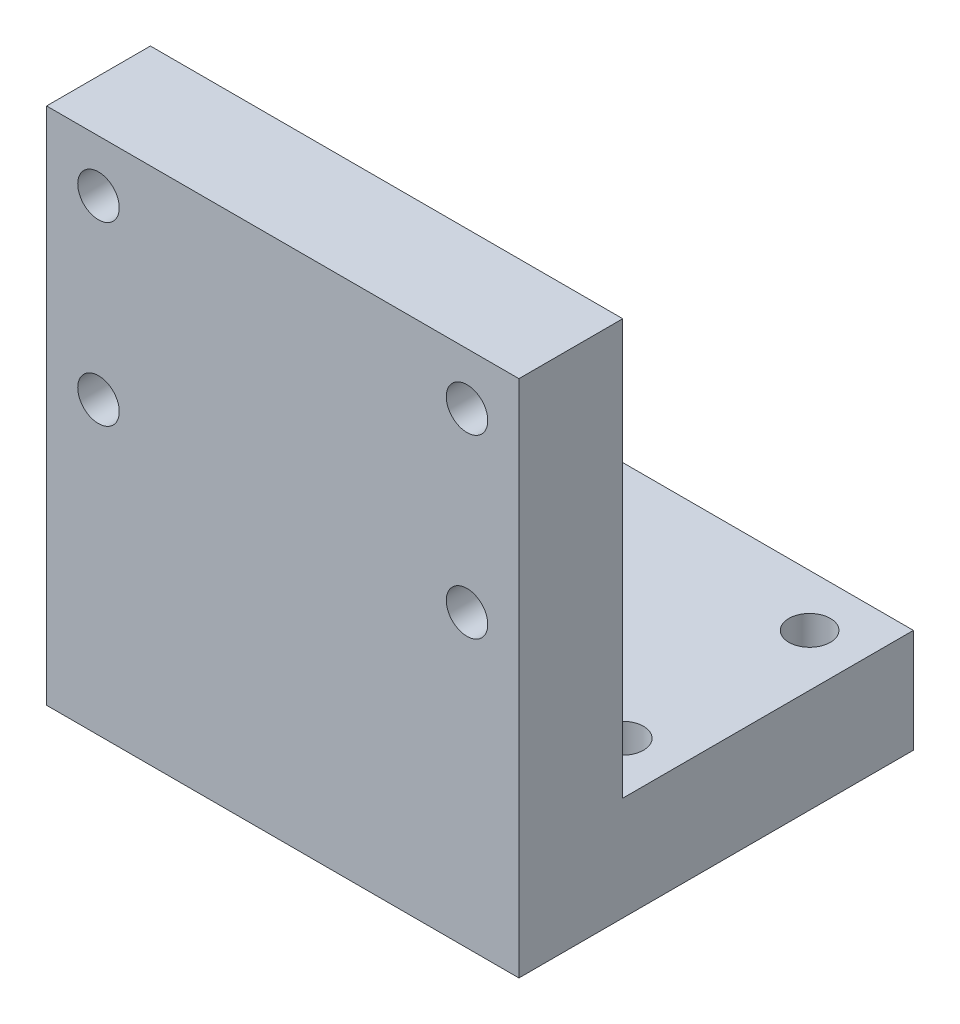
ISO-10303-21;
HEADER;
FILE_DESCRIPTION(('STEP AP214'),'2;1');
FILE_NAME('part.step','',(''),(''),'','','');
FILE_SCHEMA(('AUTOMOTIVE_DESIGN { 1 0 10303 214 1 1 1 1 }'));
ENDSEC;
DATA;
#1=APPLICATION_CONTEXT('core data for automotive mechanical design processes');
#2=APPLICATION_PROTOCOL_DEFINITION('international standard','automotive_design',2000,#1);
#3=PRODUCT_CONTEXT('',#1,'mechanical');
#4=PRODUCT('Part','Part','',(#3));
#5=PRODUCT_RELATED_PRODUCT_CATEGORY('part','',(#4));
#6=PRODUCT_DEFINITION_FORMATION('','',#4);
#7=PRODUCT_DEFINITION_CONTEXT('part definition',#1,'design');
#8=PRODUCT_DEFINITION('design','',#6,#7);
#9=PRODUCT_DEFINITION_SHAPE('','',#8);
#10=(LENGTH_UNIT() NAMED_UNIT(*) SI_UNIT(.MILLI.,.METRE.));
#11=(NAMED_UNIT(*) PLANE_ANGLE_UNIT() SI_UNIT($,.RADIAN.));
#12=(NAMED_UNIT(*) SI_UNIT($,.STERADIAN.) SOLID_ANGLE_UNIT());
#13=UNCERTAINTY_MEASURE_WITH_UNIT(LENGTH_MEASURE(1.E-05),#10,'distance_accuracy_value','');
#14=(GEOMETRIC_REPRESENTATION_CONTEXT(3) GLOBAL_UNCERTAINTY_ASSIGNED_CONTEXT((#13)) GLOBAL_UNIT_ASSIGNED_CONTEXT((#10,
#11,#12)) REPRESENTATION_CONTEXT('',''));
#15=CARTESIAN_POINT('',(0.,0.,0.));
#16=DIRECTION('',(0.,0.,1.));
#17=DIRECTION('',(1.,0.,0.));
#18=AXIS2_PLACEMENT_3D('',#15,#16,#17);
#19=CARTESIAN_POINT('',(17.75,45.,24.001));
#20=DIRECTION('',(0.,0.,-1.));
#21=DIRECTION('',(-1.,0.,0.));
#22=AXIS2_PLACEMENT_3D('',#19,#20,#21);
#23=CYLINDRICAL_SURFACE('',#22,2.00000000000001);
#24=CARTESIAN_POINT('',(17.75,45.,24.));
#25=DIRECTION('',(0.,0.,-1.));
#26=DIRECTION('',(-1.,0.,0.));
#27=AXIS2_PLACEMENT_3D('',#24,#25,#26);
#28=CIRCLE('',#27,2.00000000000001);
#29=CARTESIAN_POINT('',(15.75,45.,24.));
#30=VERTEX_POINT('',#29);
#31=EDGE_CURVE('E182',#30,#30,#28,.F.);
#32=ORIENTED_EDGE('',*,*,#31,.T.);
#33=EDGE_LOOP('',(#32));
#34=FACE_BOUND('',#33,.T.);
#35=CARTESIAN_POINT('',(17.75,45.,20.));
#36=DIRECTION('',(0.,0.,-1.));
#37=DIRECTION('',(-1.,0.,0.));
#38=AXIS2_PLACEMENT_3D('',#35,#36,#37);
#39=CIRCLE('',#38,2.00000000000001);
#40=CARTESIAN_POINT('',(15.75,45.,20.));
#41=VERTEX_POINT('',#40);
#42=EDGE_CURVE('E49',#41,#41,#39,.F.);
#43=ORIENTED_EDGE('',*,*,#42,.F.);
#44=EDGE_LOOP('',(#43));
#45=FACE_BOUND('',#44,.T.);
#46=ADVANCED_FACE('F45',(#34,#45),#23,.F.);
#47=CARTESIAN_POINT('',(17.75,28.,24.001));
#48=DIRECTION('',(0.,0.,-1.));
#49=DIRECTION('',(-1.,0.,0.));
#50=AXIS2_PLACEMENT_3D('',#47,#48,#49);
#51=CYLINDRICAL_SURFACE('',#50,2.00000000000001);
#52=CARTESIAN_POINT('',(17.75,28.,24.));
#53=DIRECTION('',(0.,0.,-1.));
#54=DIRECTION('',(-1.,0.,0.));
#55=AXIS2_PLACEMENT_3D('',#52,#53,#54);
#56=CIRCLE('',#55,2.00000000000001);
#57=CARTESIAN_POINT('',(15.75,28.,24.));
#58=VERTEX_POINT('',#57);
#59=EDGE_CURVE('E178',#58,#58,#56,.F.);
#60=ORIENTED_EDGE('',*,*,#59,.T.);
#61=EDGE_LOOP('',(#60));
#62=FACE_BOUND('',#61,.T.);
#63=CARTESIAN_POINT('',(17.75,28.,20.));
#64=DIRECTION('',(0.,0.,-1.));
#65=DIRECTION('',(-1.,0.,0.));
#66=AXIS2_PLACEMENT_3D('',#63,#64,#65);
#67=CIRCLE('',#66,2.00000000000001);
#68=CARTESIAN_POINT('',(15.75,28.,20.));
#69=VERTEX_POINT('',#68);
#70=EDGE_CURVE('E160',#69,#69,#67,.F.);
#71=ORIENTED_EDGE('',*,*,#70,.F.);
#72=EDGE_LOOP('',(#71));
#73=FACE_BOUND('',#72,.T.);
#74=ADVANCED_FACE('F318',(#62,#73),#51,.F.);
#75=CARTESIAN_POINT('',(-17.75,10.,-9.));
#76=DIRECTION('',(0.,-1.,0.));
#77=DIRECTION('',(0.,0.,-1.));
#78=AXIS2_PLACEMENT_3D('',#75,#76,#77);
#79=CYLINDRICAL_SURFACE('',#78,2.00000000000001);
#80=CARTESIAN_POINT('',(-17.75,10.,-9.));
#81=DIRECTION('',(0.,1.,0.));
#82=DIRECTION('',(0.,0.,1.));
#83=AXIS2_PLACEMENT_3D('',#80,#81,#82);
#84=CIRCLE('',#83,2.00000000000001);
#85=CARTESIAN_POINT('',(-17.75,10.,-6.99999999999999));
#86=VERTEX_POINT('',#85);
#87=EDGE_CURVE('E126',#86,#86,#84,.T.);
#88=ORIENTED_EDGE('',*,*,#87,.T.);
#89=EDGE_LOOP('',(#88));
#90=FACE_BOUND('',#89,.T.);
#91=CARTESIAN_POINT('',(-17.75,6.,-9.));
#92=DIRECTION('',(0.,-1.,0.));
#93=DIRECTION('',(0.,0.,-1.));
#94=AXIS2_PLACEMENT_3D('',#91,#92,#93);
#95=CIRCLE('',#94,2.00000000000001);
#96=CARTESIAN_POINT('',(-17.75,6.,-11.));
#97=VERTEX_POINT('',#96);
#98=EDGE_CURVE('E147',#97,#97,#95,.T.);
#99=ORIENTED_EDGE('',*,*,#98,.T.);
#100=EDGE_LOOP('',(#99));
#101=FACE_BOUND('',#100,.T.);
#102=ADVANCED_FACE('F325',(#90,#101),#79,.F.);
#103=CARTESIAN_POINT('',(-17.75,10.,9.));
#104=DIRECTION('',(0.,-1.,0.));
#105=DIRECTION('',(0.,0.,-1.));
#106=AXIS2_PLACEMENT_3D('',#103,#104,#105);
#107=CYLINDRICAL_SURFACE('',#106,2.00000000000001);
#108=CARTESIAN_POINT('',(-17.75,10.,9.));
#109=DIRECTION('',(0.,1.,0.));
#110=DIRECTION('',(0.,0.,1.));
#111=AXIS2_PLACEMENT_3D('',#108,#109,#110);
#112=CIRCLE('',#111,2.00000000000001);
#113=CARTESIAN_POINT('',(-17.75,10.,11.));
#114=VERTEX_POINT('',#113);
#115=EDGE_CURVE('E251',#114,#114,#112,.T.);
#116=ORIENTED_EDGE('',*,*,#115,.T.);
#117=EDGE_LOOP('',(#116));
#118=FACE_BOUND('',#117,.T.);
#119=CARTESIAN_POINT('',(-17.75,6.,9.));
#120=DIRECTION('',(0.,-1.,0.));
#121=DIRECTION('',(0.,0.,-1.));
#122=AXIS2_PLACEMENT_3D('',#119,#120,#121);
#123=CIRCLE('',#122,2.00000000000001);
#124=CARTESIAN_POINT('',(-17.75,6.,6.99999999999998));
#125=VERTEX_POINT('',#124);
#126=EDGE_CURVE('E143',#125,#125,#123,.T.);
#127=ORIENTED_EDGE('',*,*,#126,.T.);
#128=EDGE_LOOP('',(#127));
#129=FACE_BOUND('',#128,.T.);
#130=ADVANCED_FACE('F378',(#118,#129),#107,.F.);
#131=CARTESIAN_POINT('',(0.,10.,0.));
#132=DIRECTION('',(0.,1.,0.));
#133=DIRECTION('',(0.,0.,1.));
#134=AXIS2_PLACEMENT_3D('',#131,#132,#133);
#135=PLANE('',#134);
#136=CARTESIAN_POINT('',(17.75,10.,-9.00000000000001));
#137=DIRECTION('',(0.,1.,0.));
#138=DIRECTION('',(0.,0.,1.));
#139=AXIS2_PLACEMENT_3D('',#136,#137,#138);
#140=CIRCLE('',#139,2.00000000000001);
#141=CARTESIAN_POINT('',(17.75,10.,-6.99999999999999));
#142=VERTEX_POINT('',#141);
#143=EDGE_CURVE('E247',#142,#142,#140,.T.);
#144=ORIENTED_EDGE('',*,*,#143,.F.);
#145=EDGE_LOOP('',(#144));
#146=FACE_BOUND('',#145,.T.);
#147=ORIENTED_EDGE('',*,*,#87,.F.);
#148=EDGE_LOOP('',(#147));
#149=FACE_BOUND('',#148,.T.);
#150=DIRECTION('',(0.,0.,1.));
#151=VECTOR('',#150,1.);
#152=CARTESIAN_POINT('',(-22.75,10.,-14.));
#153=LINE('',#152,#151);
#154=CARTESIAN_POINT('',(-22.75,10.,-14.));
#155=VERTEX_POINT('',#154);
#156=CARTESIAN_POINT('',(-22.75,10.,14.));
#157=VERTEX_POINT('',#156);
#158=EDGE_CURVE('E111',#155,#157,#153,.T.);
#159=ORIENTED_EDGE('',*,*,#158,.T.);
#160=DIRECTION('',(1.,0.,0.));
#161=VECTOR('',#160,1.);
#162=CARTESIAN_POINT('',(-22.75,10.,14.));
#163=LINE('',#162,#161);
#164=CARTESIAN_POINT('',(22.75,10.,14.));
#165=VERTEX_POINT('',#164);
#166=EDGE_CURVE('E86',#157,#165,#163,.T.);
#167=ORIENTED_EDGE('',*,*,#166,.T.);
#168=DIRECTION('',(0.,0.,-1.));
#169=VECTOR('',#168,1.);
#170=CARTESIAN_POINT('',(22.75,10.,-14.));
#171=LINE('',#170,#169);
#172=CARTESIAN_POINT('',(22.75,10.,-14.));
#173=VERTEX_POINT('',#172);
#174=EDGE_CURVE('E108',#165,#173,#171,.T.);
#175=ORIENTED_EDGE('',*,*,#174,.T.);
#176=DIRECTION('',(-1.,0.,0.));
#177=VECTOR('',#176,1.);
#178=CARTESIAN_POINT('',(0.,10.,-14.));
#179=LINE('',#178,#177);
#180=EDGE_CURVE('E65',#173,#155,#179,.T.);
#181=ORIENTED_EDGE('',*,*,#180,.T.);
#182=EDGE_LOOP('',(#159,#167,#175,#181));
#183=FACE_BOUND('',#182,.T.);
#184=ORIENTED_EDGE('',*,*,#115,.F.);
#185=EDGE_LOOP('',(#184));
#186=FACE_BOUND('',#185,.T.);
#187=CARTESIAN_POINT('',(17.75,10.,9.));
#188=DIRECTION('',(0.,1.,0.));
#189=DIRECTION('',(0.,0.,1.));
#190=AXIS2_PLACEMENT_3D('',#187,#188,#189);
#191=CIRCLE('',#190,2.00000000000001);
#192=CARTESIAN_POINT('',(17.75,10.,11.));
#193=VERTEX_POINT('',#192);
#194=EDGE_CURVE('E151',#193,#193,#191,.T.);
#195=ORIENTED_EDGE('',*,*,#194,.F.);
#196=EDGE_LOOP('',(#195));
#197=FACE_BOUND('',#196,.T.);
#198=ADVANCED_FACE('F106',(#146,#149,#183,#186,#197),#135,.T.);
#199=CARTESIAN_POINT('',(0.,0.,0.));
#200=DIRECTION('',(0.,1.,0.));
#201=DIRECTION('',(0.,0.,1.));
#202=AXIS2_PLACEMENT_3D('',#199,#200,#201);
#203=PLANE('',#202);
#204=CARTESIAN_POINT('',(17.75,0.,9.));
#205=DIRECTION('',(0.,-1.,0.));
#206=DIRECTION('',(0.,0.,1.));
#207=AXIS2_PLACEMENT_3D('',#204,#205,#206);
#208=CIRCLE('',#207,3.);
#209=CARTESIAN_POINT('',(17.75,0.,12.));
#210=VERTEX_POINT('',#209);
#211=EDGE_CURVE('E231',#210,#210,#208,.T.);
#212=ORIENTED_EDGE('',*,*,#211,.F.);
#213=EDGE_LOOP('',(#212));
#214=FACE_BOUND('',#213,.T.);
#215=CARTESIAN_POINT('',(17.75,0.,-9.));
#216=DIRECTION('',(0.,-1.,0.));
#217=DIRECTION('',(0.,0.,1.));
#218=AXIS2_PLACEMENT_3D('',#215,#216,#217);
#219=CIRCLE('',#218,3.);
#220=CARTESIAN_POINT('',(17.75,0.,-6.));
#221=VERTEX_POINT('',#220);
#222=EDGE_CURVE('E223',#221,#221,#219,.T.);
#223=ORIENTED_EDGE('',*,*,#222,.F.);
#224=EDGE_LOOP('',(#223));
#225=FACE_BOUND('',#224,.T.);
#226=CARTESIAN_POINT('',(-17.75,0.,-9.));
#227=DIRECTION('',(0.,-1.,0.));
#228=DIRECTION('',(0.,0.,-1.));
#229=AXIS2_PLACEMENT_3D('',#226,#227,#228);
#230=CIRCLE('',#229,3.);
#231=CARTESIAN_POINT('',(-17.75,0.,-12.));
#232=VERTEX_POINT('',#231);
#233=EDGE_CURVE('E214',#232,#232,#230,.T.);
#234=ORIENTED_EDGE('',*,*,#233,.F.);
#235=EDGE_LOOP('',(#234));
#236=FACE_BOUND('',#235,.T.);
#237=CARTESIAN_POINT('',(-17.75,0.,9.));
#238=DIRECTION('',(0.,-1.,0.));
#239=DIRECTION('',(0.,0.,-1.));
#240=AXIS2_PLACEMENT_3D('',#237,#238,#239);
#241=CIRCLE('',#240,3.);
#242=CARTESIAN_POINT('',(-17.75,0.,6.));
#243=VERTEX_POINT('',#242);
#244=EDGE_CURVE('E218',#243,#243,#241,.T.);
#245=ORIENTED_EDGE('',*,*,#244,.F.);
#246=EDGE_LOOP('',(#245));
#247=FACE_BOUND('',#246,.T.);
#248=DIRECTION('',(0.,0.,1.));
#249=VECTOR('',#248,1.);
#250=CARTESIAN_POINT('',(-22.75,0.,-14.));
#251=LINE('',#250,#249);
#252=CARTESIAN_POINT('',(-22.75,0.,-14.));
#253=VERTEX_POINT('',#252);
#254=CARTESIAN_POINT('',(-22.75,0.,24.));
#255=VERTEX_POINT('',#254);
#256=EDGE_CURVE('E121',#253,#255,#251,.T.);
#257=ORIENTED_EDGE('',*,*,#256,.F.);
#258=DIRECTION('',(-1.,0.,0.));
#259=VECTOR('',#258,1.);
#260=CARTESIAN_POINT('',(-22.75,0.,-14.));
#261=LINE('',#260,#259);
#262=CARTESIAN_POINT('',(22.75,0.,-14.));
#263=VERTEX_POINT('',#262);
#264=EDGE_CURVE('E77',#263,#253,#261,.T.);
#265=ORIENTED_EDGE('',*,*,#264,.F.);
#266=DIRECTION('',(0.,0.,-1.));
#267=VECTOR('',#266,1.);
#268=CARTESIAN_POINT('',(22.75,0.,-14.));
#269=LINE('',#268,#267);
#270=CARTESIAN_POINT('',(22.75,0.,24.));
#271=VERTEX_POINT('',#270);
#272=EDGE_CURVE('E125',#271,#263,#269,.T.);
#273=ORIENTED_EDGE('',*,*,#272,.F.);
#274=DIRECTION('',(1.,0.,0.));
#275=VECTOR('',#274,1.);
#276=CARTESIAN_POINT('',(22.75,0.,24.));
#277=LINE('',#276,#275);
#278=EDGE_CURVE('E186',#255,#271,#277,.T.);
#279=ORIENTED_EDGE('',*,*,#278,.F.);
#280=EDGE_LOOP('',(#257,#265,#273,#279));
#281=FACE_BOUND('',#280,.T.);
#282=ADVANCED_FACE('F387',(#214,#225,#236,#247,#281),#203,.F.);
#283=CARTESIAN_POINT('',(-22.75,10.,-14.));
#284=DIRECTION('',(1.,0.,0.));
#285=DIRECTION('',(0.,0.,-1.));
#286=AXIS2_PLACEMENT_3D('',#283,#284,#285);
#287=PLANE('',#286);
#288=ORIENTED_EDGE('',*,*,#256,.T.);
#289=DIRECTION('',(0.,-1.,0.));
#290=VECTOR('',#289,1.);
#291=CARTESIAN_POINT('',(-22.75,50.,24.));
#292=LINE('',#291,#290);
#293=CARTESIAN_POINT('',(-22.75,50.,24.));
#294=VERTEX_POINT('',#293);
#295=EDGE_CURVE('E209',#294,#255,#292,.T.);
#296=ORIENTED_EDGE('',*,*,#295,.F.);
#297=DIRECTION('',(0.,0.,1.));
#298=VECTOR('',#297,1.);
#299=CARTESIAN_POINT('',(-22.75,50.,24.));
#300=LINE('',#299,#298);
#301=CARTESIAN_POINT('',(-22.75,50.,14.));
#302=VERTEX_POINT('',#301);
#303=EDGE_CURVE('E187',#302,#294,#300,.T.);
#304=ORIENTED_EDGE('',*,*,#303,.F.);
#305=DIRECTION('',(0.,-1.,0.));
#306=VECTOR('',#305,1.);
#307=CARTESIAN_POINT('',(-22.75,50.,14.));
#308=LINE('',#307,#306);
#309=EDGE_CURVE('E104',#302,#157,#308,.T.);
#310=ORIENTED_EDGE('',*,*,#309,.T.);
#311=ORIENTED_EDGE('',*,*,#158,.F.);
#312=DIRECTION('',(0.,-1.,0.));
#313=VECTOR('',#312,1.);
#314=CARTESIAN_POINT('',(-22.75,10.,-14.));
#315=LINE('',#314,#313);
#316=EDGE_CURVE('E56',#155,#253,#315,.T.);
#317=ORIENTED_EDGE('',*,*,#316,.T.);
#318=EDGE_LOOP('',(#288,#296,#304,#310,#311,#317));
#319=FACE_BOUND('',#318,.T.);
#320=ADVANCED_FACE('F47',(#319),#287,.F.);
#321=CARTESIAN_POINT('',(22.75,10.,-14.));
#322=DIRECTION('',(-1.,0.,0.));
#323=DIRECTION('',(0.,0.,1.));
#324=AXIS2_PLACEMENT_3D('',#321,#322,#323);
#325=PLANE('',#324);
#326=ORIENTED_EDGE('',*,*,#272,.T.);
#327=DIRECTION('',(0.,-1.,0.));
#328=VECTOR('',#327,1.);
#329=CARTESIAN_POINT('',(22.75,10.,-14.));
#330=LINE('',#329,#328);
#331=EDGE_CURVE('E11',#173,#263,#330,.T.);
#332=ORIENTED_EDGE('',*,*,#331,.F.);
#333=ORIENTED_EDGE('',*,*,#174,.F.);
#334=DIRECTION('',(0.,-1.,0.));
#335=VECTOR('',#334,1.);
#336=CARTESIAN_POINT('',(22.75,50.,14.));
#337=LINE('',#336,#335);
#338=CARTESIAN_POINT('',(22.75,50.,14.));
#339=VERTEX_POINT('',#338);
#340=EDGE_CURVE('E96',#339,#165,#337,.T.);
#341=ORIENTED_EDGE('',*,*,#340,.F.);
#342=DIRECTION('',(0.,0.,-1.));
#343=VECTOR('',#342,1.);
#344=CARTESIAN_POINT('',(22.75,50.,14.));
#345=LINE('',#344,#343);
#346=CARTESIAN_POINT('',(22.75,50.,24.));
#347=VERTEX_POINT('',#346);
#348=EDGE_CURVE('E195',#347,#339,#345,.T.);
#349=ORIENTED_EDGE('',*,*,#348,.F.);
#350=DIRECTION('',(0.,-1.,0.));
#351=VECTOR('',#350,1.);
#352=CARTESIAN_POINT('',(22.75,50.,24.));
#353=LINE('',#352,#351);
#354=EDGE_CURVE('E103',#347,#271,#353,.T.);
#355=ORIENTED_EDGE('',*,*,#354,.T.);
#356=EDGE_LOOP('',(#326,#332,#333,#341,#349,#355));
#357=FACE_BOUND('',#356,.T.);
#358=ADVANCED_FACE('F114',(#357),#325,.F.);
#359=CARTESIAN_POINT('',(-22.75,10.,-14.));
#360=DIRECTION('',(0.,0.,1.));
#361=DIRECTION('',(1.,0.,0.));
#362=AXIS2_PLACEMENT_3D('',#359,#360,#361);
#363=PLANE('',#362);
#364=ORIENTED_EDGE('',*,*,#264,.T.);
#365=ORIENTED_EDGE('',*,*,#316,.F.);
#366=ORIENTED_EDGE('',*,*,#180,.F.);
#367=ORIENTED_EDGE('',*,*,#331,.T.);
#368=EDGE_LOOP('',(#364,#365,#366,#367));
#369=FACE_BOUND('',#368,.T.);
#370=ADVANCED_FACE('F376',(#369),#363,.F.);
#371=CARTESIAN_POINT('',(17.75,10.,-9.00000000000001));
#372=DIRECTION('',(0.,-1.,0.));
#373=DIRECTION('',(0.,0.,-1.));
#374=AXIS2_PLACEMENT_3D('',#371,#372,#373);
#375=CYLINDRICAL_SURFACE('',#374,2.00000000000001);
#376=CARTESIAN_POINT('',(17.75,6.,-9.00000000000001));
#377=DIRECTION('',(0.,1.,0.));
#378=DIRECTION('',(0.,0.,1.));
#379=AXIS2_PLACEMENT_3D('',#376,#377,#378);
#380=CIRCLE('',#379,2.00000000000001);
#381=CARTESIAN_POINT('',(17.75,6.,-6.99999999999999));
#382=VERTEX_POINT('',#381);
#383=EDGE_CURVE('E138',#382,#382,#380,.T.);
#384=ORIENTED_EDGE('',*,*,#383,.F.);
#385=EDGE_LOOP('',(#384));
#386=FACE_BOUND('',#385,.T.);
#387=ORIENTED_EDGE('',*,*,#143,.T.);
#388=EDGE_LOOP('',(#387));
#389=FACE_BOUND('',#388,.T.);
#390=ADVANCED_FACE('F372',(#386,#389),#375,.F.);
#391=CARTESIAN_POINT('',(17.75,10.,9.));
#392=DIRECTION('',(0.,-1.,0.));
#393=DIRECTION('',(0.,0.,-1.));
#394=AXIS2_PLACEMENT_3D('',#391,#392,#393);
#395=CYLINDRICAL_SURFACE('',#394,2.00000000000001);
#396=CARTESIAN_POINT('',(17.75,6.,9.));
#397=DIRECTION('',(0.,1.,0.));
#398=DIRECTION('',(0.,0.,1.));
#399=AXIS2_PLACEMENT_3D('',#396,#397,#398);
#400=CIRCLE('',#399,2.00000000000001);
#401=CARTESIAN_POINT('',(17.75,6.,11.));
#402=VERTEX_POINT('',#401);
#403=EDGE_CURVE('E134',#402,#402,#400,.T.);
#404=ORIENTED_EDGE('',*,*,#403,.F.);
#405=EDGE_LOOP('',(#404));
#406=FACE_BOUND('',#405,.T.);
#407=ORIENTED_EDGE('',*,*,#194,.T.);
#408=EDGE_LOOP('',(#407));
#409=FACE_BOUND('',#408,.T.);
#410=ADVANCED_FACE('F359',(#406,#409),#395,.F.);
#411=CARTESIAN_POINT('',(17.75,6.,9.));
#412=DIRECTION('',(0.,-1.,0.));
#413=DIRECTION('',(0.,0.,-1.));
#414=AXIS2_PLACEMENT_3D('',#411,#412,#413);
#415=CYLINDRICAL_SURFACE('',#414,3.);
#416=CARTESIAN_POINT('',(17.75,6.,9.));
#417=DIRECTION('',(0.,-1.,0.));
#418=DIRECTION('',(0.,0.,1.));
#419=AXIS2_PLACEMENT_3D('',#416,#417,#418);
#420=CIRCLE('',#419,3.);
#421=CARTESIAN_POINT('',(17.75,6.,12.));
#422=VERTEX_POINT('',#421);
#423=EDGE_CURVE('E213',#422,#422,#420,.T.);
#424=ORIENTED_EDGE('',*,*,#423,.F.);
#425=EDGE_LOOP('',(#424));
#426=FACE_BOUND('',#425,.T.);
#427=ORIENTED_EDGE('',*,*,#211,.T.);
#428=EDGE_LOOP('',(#427));
#429=FACE_BOUND('',#428,.T.);
#430=ADVANCED_FACE('F356',(#426,#429),#415,.F.);
#431=CARTESIAN_POINT('',(17.75,6.,9.));
#432=DIRECTION('',(0.,1.,0.));
#433=DIRECTION('',(0.,0.,1.));
#434=AXIS2_PLACEMENT_3D('',#431,#432,#433);
#435=PLANE('',#434);
#436=ORIENTED_EDGE('',*,*,#403,.T.);
#437=EDGE_LOOP('',(#436));
#438=FACE_BOUND('',#437,.T.);
#439=ORIENTED_EDGE('',*,*,#423,.T.);
#440=EDGE_LOOP('',(#439));
#441=FACE_BOUND('',#440,.T.);
#442=ADVANCED_FACE('F350',(#438,#441),#435,.F.);
#443=CARTESIAN_POINT('',(17.75,6.,-9.));
#444=DIRECTION('',(0.,-1.,0.));
#445=DIRECTION('',(0.,0.,-1.));
#446=AXIS2_PLACEMENT_3D('',#443,#444,#445);
#447=CYLINDRICAL_SURFACE('',#446,3.);
#448=CARTESIAN_POINT('',(17.75,6.,-9.));
#449=DIRECTION('',(0.,-1.,0.));
#450=DIRECTION('',(0.,0.,1.));
#451=AXIS2_PLACEMENT_3D('',#448,#449,#450);
#452=CIRCLE('',#451,3.);
#453=CARTESIAN_POINT('',(17.75,6.,-6.));
#454=VERTEX_POINT('',#453);
#455=EDGE_CURVE('E227',#454,#454,#452,.T.);
#456=ORIENTED_EDGE('',*,*,#455,.F.);
#457=EDGE_LOOP('',(#456));
#458=FACE_BOUND('',#457,.T.);
#459=ORIENTED_EDGE('',*,*,#222,.T.);
#460=EDGE_LOOP('',(#459));
#461=FACE_BOUND('',#460,.T.);
#462=ADVANCED_FACE('F346',(#458,#461),#447,.F.);
#463=CARTESIAN_POINT('',(17.75,6.,-9.));
#464=DIRECTION('',(0.,1.,0.));
#465=DIRECTION('',(0.,0.,1.));
#466=AXIS2_PLACEMENT_3D('',#463,#464,#465);
#467=PLANE('',#466);
#468=ORIENTED_EDGE('',*,*,#383,.T.);
#469=EDGE_LOOP('',(#468));
#470=FACE_BOUND('',#469,.T.);
#471=ORIENTED_EDGE('',*,*,#455,.T.);
#472=EDGE_LOOP('',(#471));
#473=FACE_BOUND('',#472,.T.);
#474=ADVANCED_FACE('F349',(#470,#473),#467,.F.);
#475=CARTESIAN_POINT('',(-17.75,6.,9.));
#476=DIRECTION('',(0.,-1.,0.));
#477=DIRECTION('',(0.,0.,-1.));
#478=AXIS2_PLACEMENT_3D('',#475,#476,#477);
#479=CYLINDRICAL_SURFACE('',#478,3.);
#480=CARTESIAN_POINT('',(-17.75,6.,9.));
#481=DIRECTION('',(0.,-1.,0.));
#482=DIRECTION('',(0.,0.,-1.));
#483=AXIS2_PLACEMENT_3D('',#480,#481,#482);
#484=CIRCLE('',#483,3.);
#485=CARTESIAN_POINT('',(-17.75,6.,6.));
#486=VERTEX_POINT('',#485);
#487=EDGE_CURVE('E139',#486,#486,#484,.T.);
#488=ORIENTED_EDGE('',*,*,#487,.F.);
#489=EDGE_LOOP('',(#488));
#490=FACE_BOUND('',#489,.T.);
#491=ORIENTED_EDGE('',*,*,#244,.T.);
#492=EDGE_LOOP('',(#491));
#493=FACE_BOUND('',#492,.T.);
#494=ADVANCED_FACE('F354',(#490,#493),#479,.F.);
#495=CARTESIAN_POINT('',(-17.75,6.,9.));
#496=DIRECTION('',(0.,-1.,0.));
#497=DIRECTION('',(0.,0.,-1.));
#498=AXIS2_PLACEMENT_3D('',#495,#496,#497);
#499=PLANE('',#498);
#500=ORIENTED_EDGE('',*,*,#126,.F.);
#501=EDGE_LOOP('',(#500));
#502=FACE_BOUND('',#501,.T.);
#503=ORIENTED_EDGE('',*,*,#487,.T.);
#504=EDGE_LOOP('',(#503));
#505=FACE_BOUND('',#504,.T.);
#506=ADVANCED_FACE('F341',(#502,#505),#499,.T.);
#507=CARTESIAN_POINT('',(-17.75,6.,-9.));
#508=DIRECTION('',(0.,-1.,0.));
#509=DIRECTION('',(0.,0.,-1.));
#510=AXIS2_PLACEMENT_3D('',#507,#508,#509);
#511=CYLINDRICAL_SURFACE('',#510,3.);
#512=CARTESIAN_POINT('',(-17.75,6.,-9.));
#513=DIRECTION('',(0.,-1.,0.));
#514=DIRECTION('',(0.,0.,-1.));
#515=AXIS2_PLACEMENT_3D('',#512,#513,#514);
#516=CIRCLE('',#515,3.);
#517=CARTESIAN_POINT('',(-17.75,6.,-12.));
#518=VERTEX_POINT('',#517);
#519=EDGE_CURVE('E219',#518,#518,#516,.T.);
#520=ORIENTED_EDGE('',*,*,#519,.F.);
#521=EDGE_LOOP('',(#520));
#522=FACE_BOUND('',#521,.T.);
#523=ORIENTED_EDGE('',*,*,#233,.T.);
#524=EDGE_LOOP('',(#523));
#525=FACE_BOUND('',#524,.T.);
#526=ADVANCED_FACE('F338',(#522,#525),#511,.F.);
#527=CARTESIAN_POINT('',(-17.75,6.,-9.));
#528=DIRECTION('',(0.,-1.,0.));
#529=DIRECTION('',(0.,0.,-1.));
#530=AXIS2_PLACEMENT_3D('',#527,#528,#529);
#531=PLANE('',#530);
#532=ORIENTED_EDGE('',*,*,#98,.F.);
#533=EDGE_LOOP('',(#532));
#534=FACE_BOUND('',#533,.T.);
#535=ORIENTED_EDGE('',*,*,#519,.T.);
#536=EDGE_LOOP('',(#535));
#537=FACE_BOUND('',#536,.T.);
#538=ADVANCED_FACE('F336',(#534,#537),#531,.T.);
#539=CARTESIAN_POINT('',(22.75,50.,24.));
#540=DIRECTION('',(0.,0.,-1.));
#541=DIRECTION('',(-1.,0.,0.));
#542=AXIS2_PLACEMENT_3D('',#539,#540,#541);
#543=PLANE('',#542);
#544=CARTESIAN_POINT('',(-17.75,45.,24.));
#545=DIRECTION('',(0.,0.,-1.));
#546=DIRECTION('',(-1.,0.,0.));
#547=AXIS2_PLACEMENT_3D('',#544,#545,#546);
#548=CIRCLE('',#547,2.);
#549=CARTESIAN_POINT('',(-19.75,45.,24.));
#550=VERTEX_POINT('',#549);
#551=EDGE_CURVE('E167',#550,#550,#548,.F.);
#552=ORIENTED_EDGE('',*,*,#551,.F.);
#553=EDGE_LOOP('',(#552));
#554=FACE_BOUND('',#553,.T.);
#555=CARTESIAN_POINT('',(-17.75,28.,24.));
#556=DIRECTION('',(0.,0.,-1.));
#557=DIRECTION('',(-1.,0.,0.));
#558=AXIS2_PLACEMENT_3D('',#555,#556,#557);
#559=CIRCLE('',#558,2.);
#560=CARTESIAN_POINT('',(-19.75,28.,24.));
#561=VERTEX_POINT('',#560);
#562=EDGE_CURVE('E172',#561,#561,#559,.F.);
#563=ORIENTED_EDGE('',*,*,#562,.F.);
#564=EDGE_LOOP('',(#563));
#565=FACE_BOUND('',#564,.T.);
#566=ORIENTED_EDGE('',*,*,#59,.F.);
#567=EDGE_LOOP('',(#566));
#568=FACE_BOUND('',#567,.T.);
#569=ORIENTED_EDGE('',*,*,#31,.F.);
#570=EDGE_LOOP('',(#569));
#571=FACE_BOUND('',#570,.T.);
#572=ORIENTED_EDGE('',*,*,#278,.T.);
#573=ORIENTED_EDGE('',*,*,#354,.F.);
#574=DIRECTION('',(1.,0.,0.));
#575=VECTOR('',#574,1.);
#576=CARTESIAN_POINT('',(22.75,50.,24.));
#577=LINE('',#576,#575);
#578=EDGE_CURVE('E191',#294,#347,#577,.T.);
#579=ORIENTED_EDGE('',*,*,#578,.F.);
#580=ORIENTED_EDGE('',*,*,#295,.T.);
#581=EDGE_LOOP('',(#572,#573,#579,#580));
#582=FACE_BOUND('',#581,.T.);
#583=ADVANCED_FACE('F300',(#554,#565,#568,#571,#582),#543,.F.);
#584=CARTESIAN_POINT('',(-22.75,50.,14.));
#585=DIRECTION('',(0.,0.,1.));
#586=DIRECTION('',(1.,0.,0.));
#587=AXIS2_PLACEMENT_3D('',#584,#585,#586);
#588=PLANE('',#587);
#589=CARTESIAN_POINT('',(-17.75,45.,14.));
#590=DIRECTION('',(0.,0.,-1.));
#591=DIRECTION('',(1.,0.,0.));
#592=AXIS2_PLACEMENT_3D('',#589,#590,#591);
#593=CIRCLE('',#592,3.);
#594=CARTESIAN_POINT('',(-14.75,45.,14.));
#595=VERTEX_POINT('',#594);
#596=EDGE_CURVE('E275',#595,#595,#593,.T.);
#597=ORIENTED_EDGE('',*,*,#596,.F.);
#598=EDGE_LOOP('',(#597));
#599=FACE_BOUND('',#598,.T.);
#600=CARTESIAN_POINT('',(-17.75,28.,14.));
#601=DIRECTION('',(0.,0.,-1.));
#602=DIRECTION('',(1.,0.,0.));
#603=AXIS2_PLACEMENT_3D('',#600,#601,#602);
#604=CIRCLE('',#603,3.);
#605=CARTESIAN_POINT('',(-14.75,28.,14.));
#606=VERTEX_POINT('',#605);
#607=EDGE_CURVE('E283',#606,#606,#604,.T.);
#608=ORIENTED_EDGE('',*,*,#607,.F.);
#609=EDGE_LOOP('',(#608));
#610=FACE_BOUND('',#609,.T.);
#611=CARTESIAN_POINT('',(17.75,28.,14.));
#612=DIRECTION('',(0.,0.,-1.));
#613=DIRECTION('',(-1.,0.,0.));
#614=AXIS2_PLACEMENT_3D('',#611,#612,#613);
#615=CIRCLE('',#614,3.);
#616=CARTESIAN_POINT('',(14.75,28.,14.));
#617=VERTEX_POINT('',#616);
#618=EDGE_CURVE('E267',#617,#617,#615,.T.);
#619=ORIENTED_EDGE('',*,*,#618,.F.);
#620=EDGE_LOOP('',(#619));
#621=FACE_BOUND('',#620,.T.);
#622=CARTESIAN_POINT('',(17.75,45.,14.));
#623=DIRECTION('',(0.,0.,-1.));
#624=DIRECTION('',(-1.,0.,0.));
#625=AXIS2_PLACEMENT_3D('',#622,#623,#624);
#626=CIRCLE('',#625,3.);
#627=CARTESIAN_POINT('',(14.75,45.,14.));
#628=VERTEX_POINT('',#627);
#629=EDGE_CURVE('E263',#628,#628,#626,.T.);
#630=ORIENTED_EDGE('',*,*,#629,.F.);
#631=EDGE_LOOP('',(#630));
#632=FACE_BOUND('',#631,.T.);
#633=ORIENTED_EDGE('',*,*,#166,.F.);
#634=ORIENTED_EDGE('',*,*,#309,.F.);
#635=DIRECTION('',(-1.,0.,0.));
#636=VECTOR('',#635,1.);
#637=CARTESIAN_POINT('',(-22.75,50.,14.));
#638=LINE('',#637,#636);
#639=EDGE_CURVE('E98',#339,#302,#638,.T.);
#640=ORIENTED_EDGE('',*,*,#639,.F.);
#641=ORIENTED_EDGE('',*,*,#340,.T.);
#642=EDGE_LOOP('',(#633,#634,#640,#641));
#643=FACE_BOUND('',#642,.T.);
#644=ADVANCED_FACE('F97',(#599,#610,#621,#632,#643),#588,.F.);
#645=CARTESIAN_POINT('',(0.,50.,0.));
#646=DIRECTION('',(0.,-1.,0.));
#647=DIRECTION('',(0.,0.,-1.));
#648=AXIS2_PLACEMENT_3D('',#645,#646,#647);
#649=PLANE('',#648);
#650=ORIENTED_EDGE('',*,*,#303,.T.);
#651=ORIENTED_EDGE('',*,*,#578,.T.);
#652=ORIENTED_EDGE('',*,*,#348,.T.);
#653=ORIENTED_EDGE('',*,*,#639,.T.);
#654=EDGE_LOOP('',(#650,#651,#652,#653));
#655=FACE_BOUND('',#654,.T.);
#656=ADVANCED_FACE('F299',(#655),#649,.F.);
#657=CARTESIAN_POINT('',(-17.75,28.,24.001));
#658=DIRECTION('',(0.,0.,-1.));
#659=DIRECTION('',(-1.,0.,0.));
#660=AXIS2_PLACEMENT_3D('',#657,#658,#659);
#661=CYLINDRICAL_SURFACE('',#660,2.);
#662=CARTESIAN_POINT('',(-17.75,28.,20.));
#663=DIRECTION('',(0.,0.,1.));
#664=DIRECTION('',(1.,0.,0.));
#665=AXIS2_PLACEMENT_3D('',#662,#663,#664);
#666=CIRCLE('',#665,2.);
#667=CARTESIAN_POINT('',(-15.75,28.,20.));
#668=VERTEX_POINT('',#667);
#669=EDGE_CURVE('E156',#668,#668,#666,.F.);
#670=ORIENTED_EDGE('',*,*,#669,.T.);
#671=EDGE_LOOP('',(#670));
#672=FACE_BOUND('',#671,.T.);
#673=ORIENTED_EDGE('',*,*,#562,.T.);
#674=EDGE_LOOP('',(#673));
#675=FACE_BOUND('',#674,.T.);
#676=ADVANCED_FACE('F332',(#672,#675),#661,.F.);
#677=CARTESIAN_POINT('',(-17.75,45.,24.001));
#678=DIRECTION('',(0.,0.,-1.));
#679=DIRECTION('',(-1.,0.,0.));
#680=AXIS2_PLACEMENT_3D('',#677,#678,#679);
#681=CYLINDRICAL_SURFACE('',#680,2.);
#682=CARTESIAN_POINT('',(-17.75,45.,20.));
#683=DIRECTION('',(0.,0.,1.));
#684=DIRECTION('',(1.,0.,0.));
#685=AXIS2_PLACEMENT_3D('',#682,#683,#684);
#686=CIRCLE('',#685,2.);
#687=CARTESIAN_POINT('',(-15.75,45.,20.));
#688=VERTEX_POINT('',#687);
#689=EDGE_CURVE('E152',#688,#688,#686,.F.);
#690=ORIENTED_EDGE('',*,*,#689,.T.);
#691=EDGE_LOOP('',(#690));
#692=FACE_BOUND('',#691,.T.);
#693=ORIENTED_EDGE('',*,*,#551,.T.);
#694=EDGE_LOOP('',(#693));
#695=FACE_BOUND('',#694,.T.);
#696=ADVANCED_FACE('F329',(#692,#695),#681,.F.);
#697=CARTESIAN_POINT('',(-17.75,45.,20.));
#698=DIRECTION('',(0.,0.,1.));
#699=DIRECTION('',(1.,0.,0.));
#700=AXIS2_PLACEMENT_3D('',#697,#698,#699);
#701=PLANE('',#700);
#702=CARTESIAN_POINT('',(-17.75,45.,20.));
#703=DIRECTION('',(0.,0.,-1.));
#704=DIRECTION('',(1.,0.,0.));
#705=AXIS2_PLACEMENT_3D('',#702,#703,#704);
#706=CIRCLE('',#705,3.);
#707=CARTESIAN_POINT('',(-14.75,45.,20.));
#708=VERTEX_POINT('',#707);
#709=EDGE_CURVE('E271',#708,#708,#706,.T.);
#710=ORIENTED_EDGE('',*,*,#709,.T.);
#711=EDGE_LOOP('',(#710));
#712=FACE_BOUND('',#711,.T.);
#713=ORIENTED_EDGE('',*,*,#689,.F.);
#714=EDGE_LOOP('',(#713));
#715=FACE_BOUND('',#714,.T.);
#716=ADVANCED_FACE('F541',(#712,#715),#701,.F.);
#717=CARTESIAN_POINT('',(-17.75,45.,20.));
#718=DIRECTION('',(0.,0.,-1.));
#719=DIRECTION('',(-1.,0.,0.));
#720=AXIS2_PLACEMENT_3D('',#717,#718,#719);
#721=CYLINDRICAL_SURFACE('',#720,3.);
#722=ORIENTED_EDGE('',*,*,#709,.F.);
#723=EDGE_LOOP('',(#722));
#724=FACE_BOUND('',#723,.T.);
#725=ORIENTED_EDGE('',*,*,#596,.T.);
#726=EDGE_LOOP('',(#725));
#727=FACE_BOUND('',#726,.T.);
#728=ADVANCED_FACE('F559',(#724,#727),#721,.F.);
#729=CARTESIAN_POINT('',(-17.75,28.,20.));
#730=DIRECTION('',(0.,0.,1.));
#731=DIRECTION('',(1.,0.,0.));
#732=AXIS2_PLACEMENT_3D('',#729,#730,#731);
#733=PLANE('',#732);
#734=CARTESIAN_POINT('',(-17.75,28.,20.));
#735=DIRECTION('',(0.,0.,-1.));
#736=DIRECTION('',(1.,0.,0.));
#737=AXIS2_PLACEMENT_3D('',#734,#735,#736);
#738=CIRCLE('',#737,3.);
#739=CARTESIAN_POINT('',(-14.75,28.,20.));
#740=VERTEX_POINT('',#739);
#741=EDGE_CURVE('E279',#740,#740,#738,.T.);
#742=ORIENTED_EDGE('',*,*,#741,.T.);
#743=EDGE_LOOP('',(#742));
#744=FACE_BOUND('',#743,.T.);
#745=ORIENTED_EDGE('',*,*,#669,.F.);
#746=EDGE_LOOP('',(#745));
#747=FACE_BOUND('',#746,.T.);
#748=ADVANCED_FACE('F569',(#744,#747),#733,.F.);
#749=CARTESIAN_POINT('',(-17.75,28.,20.));
#750=DIRECTION('',(0.,0.,-1.));
#751=DIRECTION('',(-1.,0.,0.));
#752=AXIS2_PLACEMENT_3D('',#749,#750,#751);
#753=CYLINDRICAL_SURFACE('',#752,3.);
#754=ORIENTED_EDGE('',*,*,#741,.F.);
#755=EDGE_LOOP('',(#754));
#756=FACE_BOUND('',#755,.T.);
#757=ORIENTED_EDGE('',*,*,#607,.T.);
#758=EDGE_LOOP('',(#757));
#759=FACE_BOUND('',#758,.T.);
#760=ADVANCED_FACE('F579',(#756,#759),#753,.F.);
#761=CARTESIAN_POINT('',(17.75,28.,20.));
#762=DIRECTION('',(0.,0.,-1.));
#763=DIRECTION('',(-1.,0.,0.));
#764=AXIS2_PLACEMENT_3D('',#761,#762,#763);
#765=PLANE('',#764);
#766=CARTESIAN_POINT('',(17.75,28.,20.));
#767=DIRECTION('',(0.,0.,-1.));
#768=DIRECTION('',(-1.,0.,0.));
#769=AXIS2_PLACEMENT_3D('',#766,#767,#768);
#770=CIRCLE('',#769,3.);
#771=CARTESIAN_POINT('',(14.75,28.,20.));
#772=VERTEX_POINT('',#771);
#773=EDGE_CURVE('E287',#772,#772,#770,.T.);
#774=ORIENTED_EDGE('',*,*,#773,.T.);
#775=EDGE_LOOP('',(#774));
#776=FACE_BOUND('',#775,.T.);
#777=ORIENTED_EDGE('',*,*,#70,.T.);
#778=EDGE_LOOP('',(#777));
#779=FACE_BOUND('',#778,.T.);
#780=ADVANCED_FACE('F589',(#776,#779),#765,.T.);
#781=CARTESIAN_POINT('',(17.75,28.,20.));
#782=DIRECTION('',(0.,0.,-1.));
#783=DIRECTION('',(-1.,0.,0.));
#784=AXIS2_PLACEMENT_3D('',#781,#782,#783);
#785=CYLINDRICAL_SURFACE('',#784,3.);
#786=ORIENTED_EDGE('',*,*,#773,.F.);
#787=EDGE_LOOP('',(#786));
#788=FACE_BOUND('',#787,.T.);
#789=ORIENTED_EDGE('',*,*,#618,.T.);
#790=EDGE_LOOP('',(#789));
#791=FACE_BOUND('',#790,.T.);
#792=ADVANCED_FACE('F295',(#788,#791),#785,.F.);
#793=CARTESIAN_POINT('',(17.75,45.,20.));
#794=DIRECTION('',(0.,0.,-1.));
#795=DIRECTION('',(-1.,0.,0.));
#796=AXIS2_PLACEMENT_3D('',#793,#794,#795);
#797=PLANE('',#796);
#798=CARTESIAN_POINT('',(17.75,45.,20.));
#799=DIRECTION('',(0.,0.,-1.));
#800=DIRECTION('',(-1.,0.,0.));
#801=AXIS2_PLACEMENT_3D('',#798,#799,#800);
#802=CIRCLE('',#801,3.);
#803=CARTESIAN_POINT('',(14.75,45.,20.));
#804=VERTEX_POINT('',#803);
#805=EDGE_CURVE('E157',#804,#804,#802,.T.);
#806=ORIENTED_EDGE('',*,*,#805,.T.);
#807=EDGE_LOOP('',(#806));
#808=FACE_BOUND('',#807,.T.);
#809=ORIENTED_EDGE('',*,*,#42,.T.);
#810=EDGE_LOOP('',(#809));
#811=FACE_BOUND('',#810,.T.);
#812=ADVANCED_FACE('F307',(#808,#811),#797,.T.);
#813=CARTESIAN_POINT('',(17.75,45.,20.));
#814=DIRECTION('',(0.,0.,-1.));
#815=DIRECTION('',(-1.,0.,0.));
#816=AXIS2_PLACEMENT_3D('',#813,#814,#815);
#817=CYLINDRICAL_SURFACE('',#816,3.);
#818=ORIENTED_EDGE('',*,*,#805,.F.);
#819=EDGE_LOOP('',(#818));
#820=FACE_BOUND('',#819,.T.);
#821=ORIENTED_EDGE('',*,*,#629,.T.);
#822=EDGE_LOOP('',(#821));
#823=FACE_BOUND('',#822,.T.);
#824=ADVANCED_FACE('F305',(#820,#823),#817,.F.);
#825=CLOSED_SHELL('',(#46,#74,#102,#130,#198,#282,#320,#358,#370,#390,#410,#430,#442,#462,#474,
#494,#506,#526,#538,#583,#644,#656,#676,#696,#716,#728,#748,#760,#780,#792,#812,#824));
#826=MANIFOLD_SOLID_BREP('B2',#825);
#827=ADVANCED_BREP_SHAPE_REPRESENTATION('',(#18,#826),#14);
#828=SHAPE_DEFINITION_REPRESENTATION(#9,#827);
ENDSEC;
END-ISO-10303-21;
